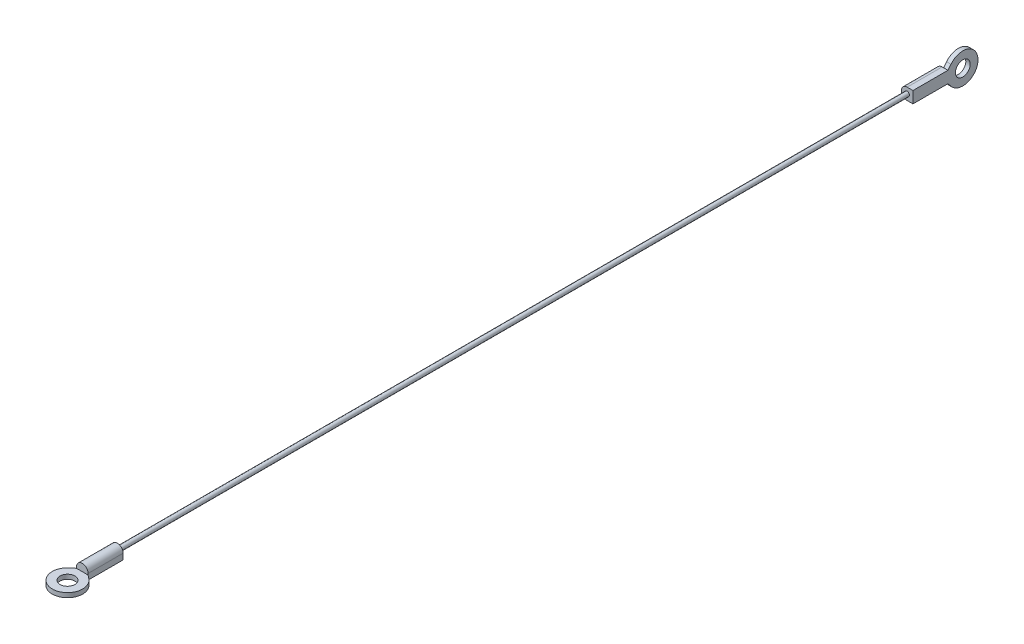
from build123d import *

# Parameters (mm, degrees)
SKETCH1_R           = 0.795
BOSS_EXTRUDE1_DEPTH = 135.32
BOSS_EXTRUDE2_DEPTH = 12
SKETCH3_R           = 2.54
BOSS_EXTRUDE3_DEPTH = 1.52
BOSS_EXTRUDE4_START = 12
BOSS_EXTRUDE4_DEPTH = 12
SKETCH5_R           = 2.54
BOSS_EXTRUDE5_DEPTH = 1.52


with BuildPart() as part:
    # Sketch1 → Boss-Extrude1 (new, symmetric)
    with BuildSketch(Plane.XY):
        Circle(SKETCH1_R)
    extrude(amount=BOSS_EXTRUDE1_DEPTH, both=True)

    # Sketch2 → Boss-Extrude2 (add)
    with BuildSketch(Plane.XY.offset(135.32)):
        with BuildLine():
            Line((-1.99, 0), (-1.99, -1.99))
            Line((-1.99, -1.99), (0, -1.99))
            Line((0, -1.99), (1.99, -1.99))
            Line((1.99, -1.99), (1.99, 0))
            ThreePointArc((1.99, 0), (0, 1.99), (-1.99, 0))
        make_face()
    extrude(amount=BOSS_EXTRUDE2_DEPTH)

    # Sketch3 → Boss-Extrude3 (add)
    with BuildSketch(Plane.XZ.offset(1.99)):
        with BuildLine():
            Line((1.99, 147.32), (3.263901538, 148.345499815))
            ThreePointArc((3.263901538, 148.345499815), (0, 157.605), (-3.263901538, 148.345499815))
            Line((-3.263901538, 148.345499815), (-1.99, 147.32))
            Line((-1.99, 147.32), (1.99, 147.32))
        make_face()
        with Locations(Location((0, 152.4, 0), (0, 0, 270))):
            Circle(SKETCH3_R, mode=Mode.SUBTRACT)
    extrude(amount=-BOSS_EXTRUDE3_DEPTH)

    # Sketch4 → Boss-Extrude4 (add)
    with BuildSketch(Plane(origin=(0, 0, -135.32), x_dir=(-1, 0, 0), z_dir=(0, 0, -1)).offset(BOSS_EXTRUDE4_START)):
        with BuildLine():
            Line((0, 1.99), (-1.99, 1.99))
            Line((-1.99, 1.99), (-1.99, 0))
            Line((-1.99, 0), (-1.99, -1.99))
            Line((-1.99, -1.99), (0, -1.99))
            ThreePointArc((0, -1.99), (1.99, 0), (0, 1.99))
        make_face()
    extrude(amount=-BOSS_EXTRUDE4_DEPTH)

    # Sketch5 → Boss-Extrude5 (add)
    with BuildSketch(Plane(origin=(1.99, 0, 0), x_dir=(0, 0, -1), z_dir=(1, 0, 0))):
        with BuildLine():
            Line((147.32, -1.99), (147.32, 1.99))
            Line((147.32, 1.99), (148.345499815, 3.263901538))
            ThreePointArc((148.345499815, 3.263901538), (157.605, 0), (148.345499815, -3.263901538))
            Line((148.345499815, -3.263901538), (147.32, -1.99))
        make_face()
        with Locations((152.4, 0)):
            Circle(SKETCH5_R, mode=Mode.SUBTRACT)
    extrude(amount=-BOSS_EXTRUDE5_DEPTH)


solid = part.part
